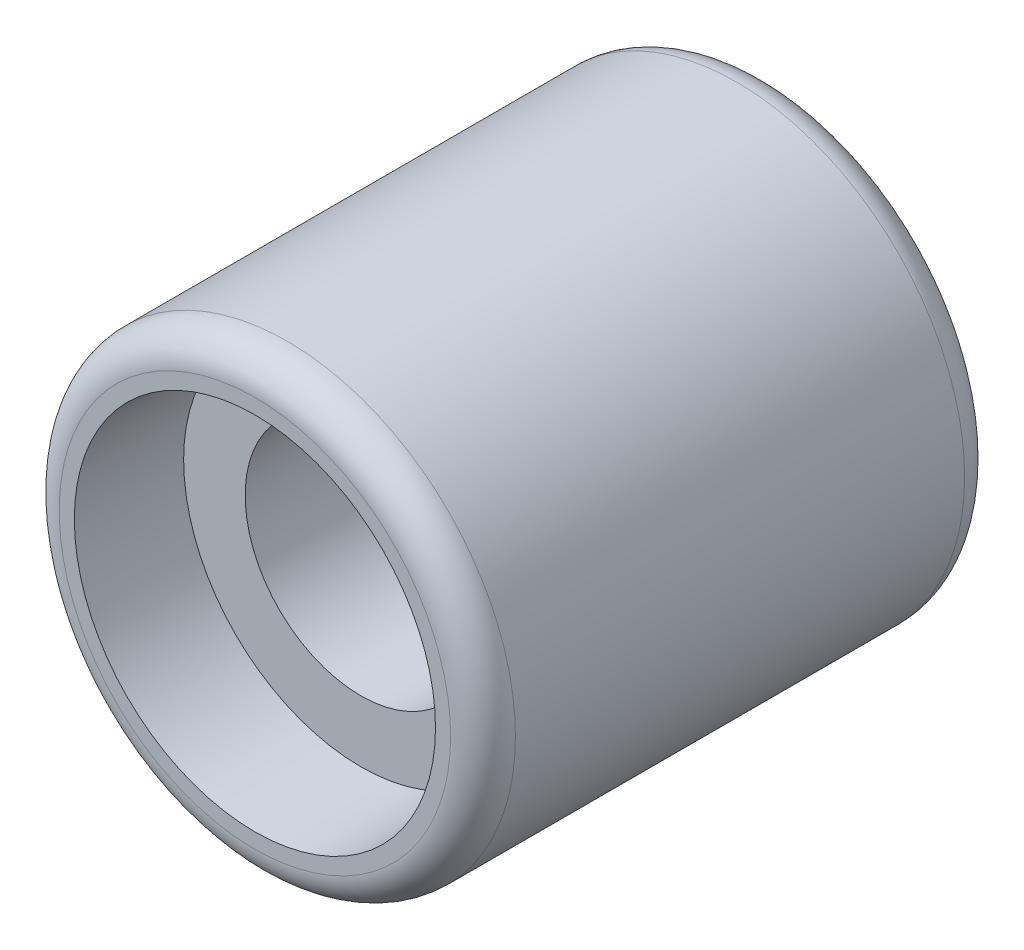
ISO-10303-21;
HEADER;
FILE_DESCRIPTION(('STEP AP214'),'2;1');
FILE_NAME('part.step','',(''),(''),'','','');
FILE_SCHEMA(('AUTOMOTIVE_DESIGN { 1 0 10303 214 1 1 1 1 }'));
ENDSEC;
DATA;
#1=APPLICATION_CONTEXT('core data for automotive mechanical design processes');
#2=APPLICATION_PROTOCOL_DEFINITION('international standard','automotive_design',2000,#1);
#3=PRODUCT_CONTEXT('',#1,'mechanical');
#4=PRODUCT('Part','Part','',(#3));
#5=PRODUCT_RELATED_PRODUCT_CATEGORY('part','',(#4));
#6=PRODUCT_DEFINITION_FORMATION('','',#4);
#7=PRODUCT_DEFINITION_CONTEXT('part definition',#1,'design');
#8=PRODUCT_DEFINITION('design','',#6,#7);
#9=PRODUCT_DEFINITION_SHAPE('','',#8);
#10=(LENGTH_UNIT() NAMED_UNIT(*) SI_UNIT(.MILLI.,.METRE.));
#11=(NAMED_UNIT(*) PLANE_ANGLE_UNIT() SI_UNIT($,.RADIAN.));
#12=(NAMED_UNIT(*) SI_UNIT($,.STERADIAN.) SOLID_ANGLE_UNIT());
#13=UNCERTAINTY_MEASURE_WITH_UNIT(LENGTH_MEASURE(1.E-05),#10,'distance_accuracy_value','');
#14=(GEOMETRIC_REPRESENTATION_CONTEXT(3) GLOBAL_UNCERTAINTY_ASSIGNED_CONTEXT((#13)) GLOBAL_UNIT_ASSIGNED_CONTEXT((#10,
#11,#12)) REPRESENTATION_CONTEXT('',''));
#15=CARTESIAN_POINT('',(0.,0.,0.));
#16=DIRECTION('',(0.,0.,1.));
#17=DIRECTION('',(1.,0.,0.));
#18=AXIS2_PLACEMENT_3D('',#15,#16,#17);
#19=CARTESIAN_POINT('',(0.,0.,42.926));
#20=DIRECTION('',(0.,0.,1.));
#21=DIRECTION('',(1.,0.,0.));
#22=AXIS2_PLACEMENT_3D('',#19,#20,#21);
#23=PLANE('',#22);
#24=CARTESIAN_POINT('',(0.,0.,42.926));
#25=DIRECTION('',(0.,0.,1.));
#26=DIRECTION('',(1.,0.,0.));
#27=AXIS2_PLACEMENT_3D('',#24,#25,#26);
#28=CIRCLE('',#27,32.68726);
#29=CARTESIAN_POINT('',(32.68726,0.,42.926));
#30=VERTEX_POINT('',#29);
#31=EDGE_CURVE('E49',#30,#30,#28,.T.);
#32=ORIENTED_EDGE('',*,*,#31,.T.);
#33=EDGE_LOOP('',(#32));
#34=FACE_BOUND('',#33,.T.);
#35=CARTESIAN_POINT('',(0.,0.,42.926));
#36=DIRECTION('',(0.,0.,-1.));
#37=DIRECTION('',(0.,1.,0.));
#38=AXIS2_PLACEMENT_3D('',#35,#36,#37);
#39=CIRCLE('',#38,30.1625);
#40=CARTESIAN_POINT('',(0.,30.1625,42.926));
#41=VERTEX_POINT('',#40);
#42=EDGE_CURVE('E58',#41,#41,#39,.T.);
#43=ORIENTED_EDGE('',*,*,#42,.T.);
#44=EDGE_LOOP('',(#43));
#45=FACE_BOUND('',#44,.T.);
#46=ADVANCED_FACE('F32',(#34,#45),#23,.T.);
#47=CARTESIAN_POINT('',(0.,0.,-42.926));
#48=DIRECTION('',(0.,0.,1.));
#49=DIRECTION('',(1.,0.,0.));
#50=AXIS2_PLACEMENT_3D('',#47,#48,#49);
#51=PLANE('',#50);
#52=CARTESIAN_POINT('',(0.,0.,-42.926));
#53=DIRECTION('',(0.,0.,-1.));
#54=DIRECTION('',(0.,1.,0.));
#55=AXIS2_PLACEMENT_3D('',#52,#53,#54);
#56=CIRCLE('',#55,30.1625);
#57=CARTESIAN_POINT('',(0.,30.1625,-42.926));
#58=VERTEX_POINT('',#57);
#59=EDGE_CURVE('E64',#58,#58,#56,.T.);
#60=ORIENTED_EDGE('',*,*,#59,.F.);
#61=EDGE_LOOP('',(#60));
#62=FACE_BOUND('',#61,.T.);
#63=CARTESIAN_POINT('',(0.,0.,-42.926));
#64=DIRECTION('',(0.,0.,1.));
#65=DIRECTION('',(1.,0.,0.));
#66=AXIS2_PLACEMENT_3D('',#63,#64,#65);
#67=CIRCLE('',#66,32.68726);
#68=CARTESIAN_POINT('',(32.68726,0.,-42.926));
#69=VERTEX_POINT('',#68);
#70=EDGE_CURVE('E10',#69,#69,#67,.F.);
#71=ORIENTED_EDGE('',*,*,#70,.T.);
#72=EDGE_LOOP('',(#71));
#73=FACE_BOUND('',#72,.T.);
#74=ADVANCED_FACE('F71',(#62,#73),#51,.F.);
#75=CARTESIAN_POINT('',(0.,0.,42.926));
#76=DIRECTION('',(0.,0.,-1.));
#77=DIRECTION('',(-1.,0.,0.));
#78=AXIS2_PLACEMENT_3D('',#75,#76,#77);
#79=CYLINDRICAL_SURFACE('',#78,38.1);
#80=CARTESIAN_POINT('',(0.,0.,37.51326));
#81=DIRECTION('',(0.,0.,1.));
#82=DIRECTION('',(1.,0.,0.));
#83=AXIS2_PLACEMENT_3D('',#80,#81,#82);
#84=CIRCLE('',#83,38.1);
#85=CARTESIAN_POINT('',(38.1,0.,37.51326));
#86=VERTEX_POINT('',#85);
#87=EDGE_CURVE('E40',#86,#86,#84,.F.);
#88=ORIENTED_EDGE('',*,*,#87,.T.);
#89=EDGE_LOOP('',(#88));
#90=FACE_BOUND('',#89,.T.);
#91=CARTESIAN_POINT('',(0.,0.,-37.51326));
#92=DIRECTION('',(0.,0.,1.));
#93=DIRECTION('',(1.,0.,0.));
#94=AXIS2_PLACEMENT_3D('',#91,#92,#93);
#95=CIRCLE('',#94,38.1);
#96=CARTESIAN_POINT('',(38.1,0.,-37.51326));
#97=VERTEX_POINT('',#96);
#98=EDGE_CURVE('E44',#97,#97,#95,.T.);
#99=ORIENTED_EDGE('',*,*,#98,.T.);
#100=EDGE_LOOP('',(#99));
#101=FACE_BOUND('',#100,.T.);
#102=ADVANCED_FACE('F73',(#90,#101),#79,.T.);
#103=CARTESIAN_POINT('',(0.,0.,97.6193518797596));
#104=DIRECTION('',(0.,0.,-1.));
#105=DIRECTION('',(-1.,0.,0.));
#106=AXIS2_PLACEMENT_3D('',#103,#104,#105);
#107=CYLINDRICAL_SURFACE('',#106,19.33702);
#108=CARTESIAN_POINT('',(0.,0.,-25.2222));
#109=DIRECTION('',(0.,0.,1.));
#110=DIRECTION('',(0.,-1.,0.));
#111=AXIS2_PLACEMENT_3D('',#108,#109,#110);
#112=CIRCLE('',#111,19.33702);
#113=CARTESIAN_POINT('',(0.,-19.33702,-25.2222));
#114=VERTEX_POINT('',#113);
#115=EDGE_CURVE('E36',#114,#114,#112,.T.);
#116=ORIENTED_EDGE('',*,*,#115,.F.);
#117=EDGE_LOOP('',(#116));
#118=FACE_BOUND('',#117,.T.);
#119=CARTESIAN_POINT('',(0.,0.,25.2222));
#120=DIRECTION('',(0.,0.,-1.));
#121=DIRECTION('',(0.,1.,0.));
#122=AXIS2_PLACEMENT_3D('',#119,#120,#121);
#123=CIRCLE('',#122,19.33702);
#124=CARTESIAN_POINT('',(0.,19.33702,25.2222));
#125=VERTEX_POINT('',#124);
#126=EDGE_CURVE('E52',#125,#125,#123,.T.);
#127=ORIENTED_EDGE('',*,*,#126,.F.);
#128=EDGE_LOOP('',(#127));
#129=FACE_BOUND('',#128,.T.);
#130=ADVANCED_FACE('F79',(#118,#129),#107,.F.);
#131=CARTESIAN_POINT('',(0.,0.,25.2222));
#132=DIRECTION('',(0.,0.,-1.));
#133=DIRECTION('',(0.,1.,0.));
#134=AXIS2_PLACEMENT_3D('',#131,#132,#133);
#135=PLANE('',#134);
#136=ORIENTED_EDGE('',*,*,#126,.T.);
#137=EDGE_LOOP('',(#136));
#138=FACE_BOUND('',#137,.T.);
#139=CARTESIAN_POINT('',(0.,0.,25.2222));
#140=DIRECTION('',(0.,0.,-1.));
#141=DIRECTION('',(0.,1.,0.));
#142=AXIS2_PLACEMENT_3D('',#139,#140,#141);
#143=CIRCLE('',#142,29.6112905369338);
#144=CARTESIAN_POINT('',(0.,29.6112905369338,25.2222));
#145=VERTEX_POINT('',#144);
#146=EDGE_CURVE('E55',#145,#145,#143,.T.);
#147=ORIENTED_EDGE('',*,*,#146,.F.);
#148=EDGE_LOOP('',(#147));
#149=FACE_BOUND('',#148,.T.);
#150=ADVANCED_FACE('F95',(#138,#149),#135,.F.);
#151=CARTESIAN_POINT('',(0.,0.,25.2222));
#152=DIRECTION('',(0.,0.,1.));
#153=DIRECTION('',(0.,-1.,0.));
#154=AXIS2_PLACEMENT_3D('',#151,#152,#153);
#155=CONICAL_SURFACE('',#154,29.6112905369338,0.0311250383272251);
#156=ORIENTED_EDGE('',*,*,#42,.F.);
#157=EDGE_LOOP('',(#156));
#158=FACE_BOUND('',#157,.T.);
#159=ORIENTED_EDGE('',*,*,#146,.T.);
#160=EDGE_LOOP('',(#159));
#161=FACE_BOUND('',#160,.T.);
#162=ADVANCED_FACE('F87',(#158,#161),#155,.F.);
#163=CARTESIAN_POINT('',(0.,0.,37.51326));
#164=DIRECTION('',(0.,0.,1.));
#165=DIRECTION('',(1.,0.,0.));
#166=AXIS2_PLACEMENT_3D('',#163,#164,#165);
#167=TOROIDAL_SURFACE('',#166,32.68726,5.41274);
#168=ORIENTED_EDGE('',*,*,#87,.F.);
#169=EDGE_LOOP('',(#168));
#170=FACE_BOUND('',#169,.T.);
#171=ORIENTED_EDGE('',*,*,#31,.F.);
#172=EDGE_LOOP('',(#171));
#173=FACE_BOUND('',#172,.T.);
#174=ADVANCED_FACE('F85',(#170,#173),#167,.T.);
#175=CARTESIAN_POINT('',(0.,0.,-37.51326));
#176=DIRECTION('',(0.,0.,1.));
#177=DIRECTION('',(1.,0.,0.));
#178=AXIS2_PLACEMENT_3D('',#175,#176,#177);
#179=TOROIDAL_SURFACE('',#178,32.68726,5.41274);
#180=ORIENTED_EDGE('',*,*,#70,.F.);
#181=EDGE_LOOP('',(#180));
#182=FACE_BOUND('',#181,.T.);
#183=ORIENTED_EDGE('',*,*,#98,.F.);
#184=EDGE_LOOP('',(#183));
#185=FACE_BOUND('',#184,.T.);
#186=ADVANCED_FACE('F34',(#182,#185),#179,.T.);
#187=CARTESIAN_POINT('',(0.,0.,-25.2222));
#188=DIRECTION('',(0.,0.,1.));
#189=DIRECTION('',(0.,1.,0.));
#190=AXIS2_PLACEMENT_3D('',#187,#188,#189);
#191=PLANE('',#190);
#192=ORIENTED_EDGE('',*,*,#115,.T.);
#193=EDGE_LOOP('',(#192));
#194=FACE_BOUND('',#193,.T.);
#195=CARTESIAN_POINT('',(0.,0.,-25.2222));
#196=DIRECTION('',(0.,0.,-1.));
#197=DIRECTION('',(0.,1.,0.));
#198=AXIS2_PLACEMENT_3D('',#195,#196,#197);
#199=CIRCLE('',#198,29.6112905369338);
#200=CARTESIAN_POINT('',(0.,29.6112905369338,-25.2222));
#201=VERTEX_POINT('',#200);
#202=EDGE_CURVE('E61',#201,#201,#199,.T.);
#203=ORIENTED_EDGE('',*,*,#202,.T.);
#204=EDGE_LOOP('',(#203));
#205=FACE_BOUND('',#204,.T.);
#206=ADVANCED_FACE('F93',(#194,#205),#191,.F.);
#207=CARTESIAN_POINT('',(0.,0.,-25.2222));
#208=DIRECTION('',(0.,0.,-1.));
#209=DIRECTION('',(0.,-1.,0.));
#210=AXIS2_PLACEMENT_3D('',#207,#208,#209);
#211=CONICAL_SURFACE('',#210,29.6112905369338,0.0311250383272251);
#212=ORIENTED_EDGE('',*,*,#59,.T.);
#213=EDGE_LOOP('',(#212));
#214=FACE_BOUND('',#213,.T.);
#215=ORIENTED_EDGE('',*,*,#202,.F.);
#216=EDGE_LOOP('',(#215));
#217=FACE_BOUND('',#216,.T.);
#218=ADVANCED_FACE('F68',(#214,#217),#211,.F.);
#219=CLOSED_SHELL('',(#46,#74,#102,#130,#150,#162,#174,#186,#206,#218));
#220=MANIFOLD_SOLID_BREP('B2',#219);
#221=ADVANCED_BREP_SHAPE_REPRESENTATION('',(#18,#220),#14);
#222=SHAPE_DEFINITION_REPRESENTATION(#9,#221);
ENDSEC;
END-ISO-10303-21;
